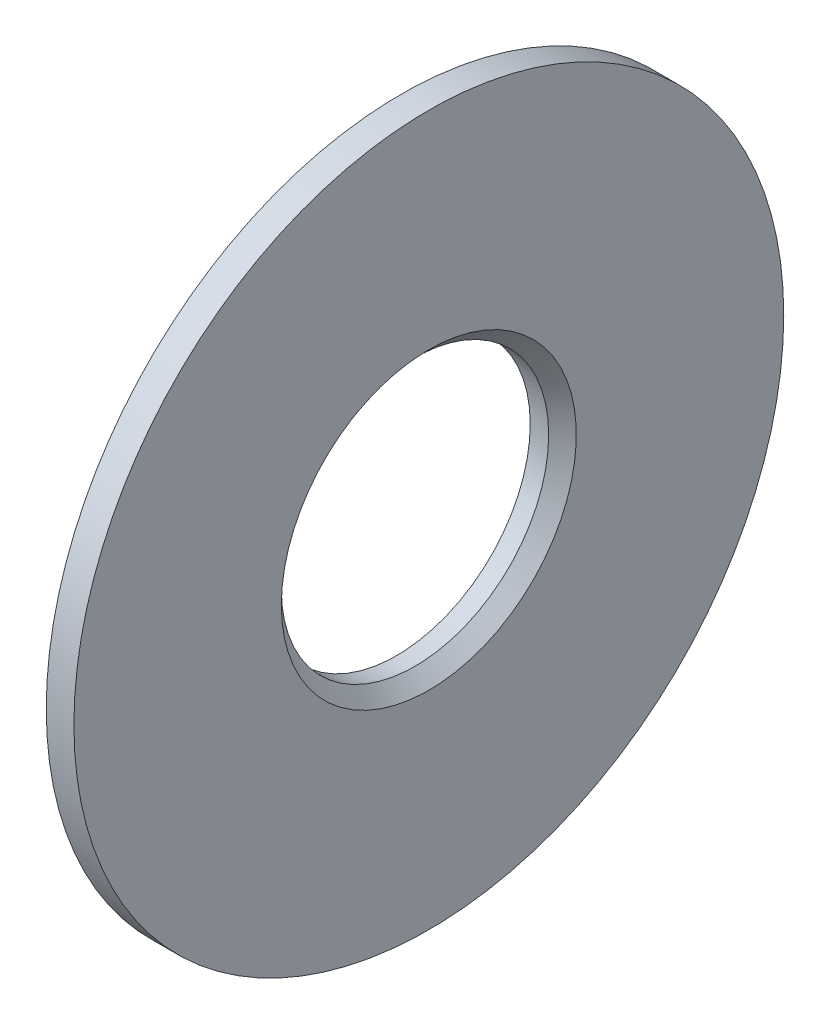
from build123d import *


with BuildPart() as part:
    # Esquisse1 → R_volution1 (revolve)
    with BuildSketch(Plane.XY, mode=Mode.PRIVATE) as r_volution1_sk:
        Polygon((0, 72.5), (10, 72.5), (17.5, 80), (17.5, 192.5), (2.5, 192.5), (2.5, 87.5), (0, 85), align=None)
    revolve(r_volution1_sk.sketch.rotate(Axis((0, 0, 0), (1, 0, 0)), 90), axis=Axis((0, 0, 0), (1, 0, 0)))


solid = part.part
